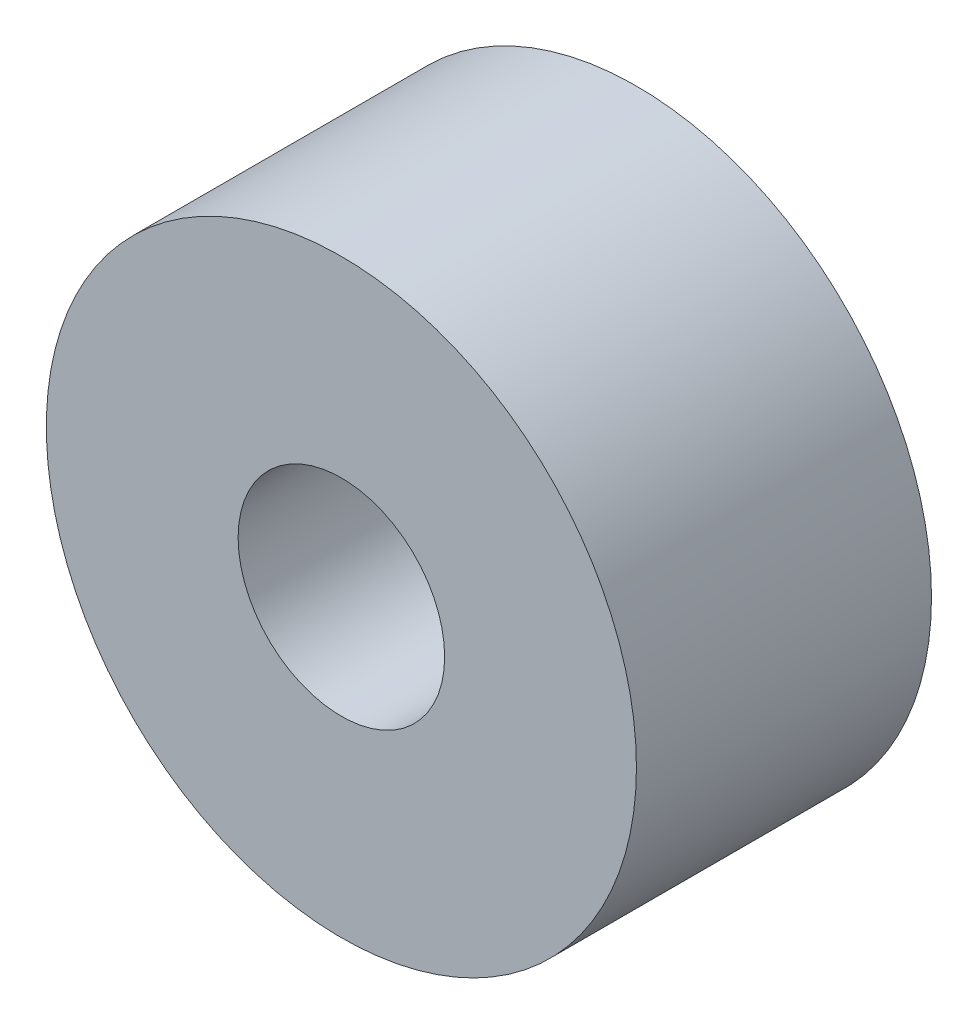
from build123d import *

# Parameters (mm, degrees)
ESQUISSE1_R          = 20
ESQUISSE1_R_2        = 7
BASE_EXTRUSION_DEPTH = 20


with BuildPart() as part:
    # Esquisse1 → Base-Extrusion (new body)
    with BuildSketch(Plane.XY):
        Circle(ESQUISSE1_R)
        Circle(ESQUISSE1_R_2, mode=Mode.SUBTRACT)
    extrude(amount=BASE_EXTRUSION_DEPTH)


solid = part.part
